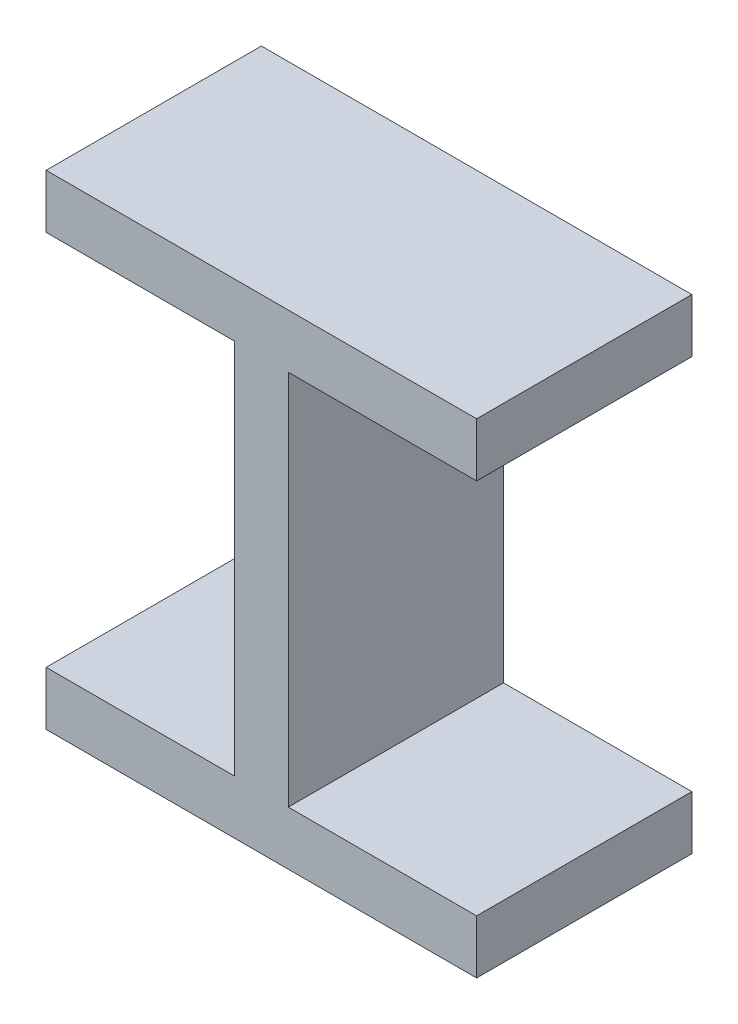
ISO-10303-21;
HEADER;
FILE_DESCRIPTION(('STEP AP214'),'2;1');
FILE_NAME('part.step','',(''),(''),'','','');
FILE_SCHEMA(('AUTOMOTIVE_DESIGN { 1 0 10303 214 1 1 1 1 }'));
ENDSEC;
DATA;
#1=APPLICATION_CONTEXT('core data for automotive mechanical design processes');
#2=APPLICATION_PROTOCOL_DEFINITION('international standard','automotive_design',2000,#1);
#3=PRODUCT_CONTEXT('',#1,'mechanical');
#4=PRODUCT('Part','Part','',(#3));
#5=PRODUCT_RELATED_PRODUCT_CATEGORY('part','',(#4));
#6=PRODUCT_DEFINITION_FORMATION('','',#4);
#7=PRODUCT_DEFINITION_CONTEXT('part definition',#1,'design');
#8=PRODUCT_DEFINITION('design','',#6,#7);
#9=PRODUCT_DEFINITION_SHAPE('','',#8);
#10=(LENGTH_UNIT() NAMED_UNIT(*) SI_UNIT(.MILLI.,.METRE.));
#11=(NAMED_UNIT(*) PLANE_ANGLE_UNIT() SI_UNIT($,.RADIAN.));
#12=(NAMED_UNIT(*) SI_UNIT($,.STERADIAN.) SOLID_ANGLE_UNIT());
#13=UNCERTAINTY_MEASURE_WITH_UNIT(LENGTH_MEASURE(1.E-05),#10,'distance_accuracy_value','');
#14=(GEOMETRIC_REPRESENTATION_CONTEXT(3) GLOBAL_UNCERTAINTY_ASSIGNED_CONTEXT((#13)) GLOBAL_UNIT_ASSIGNED_CONTEXT((#10,
#11,#12)) REPRESENTATION_CONTEXT('',''));
#15=CARTESIAN_POINT('',(0.,0.,0.));
#16=DIRECTION('',(0.,0.,1.));
#17=DIRECTION('',(1.,0.,0.));
#18=AXIS2_PLACEMENT_3D('',#15,#16,#17);
#19=CARTESIAN_POINT('',(0.,90.,80.));
#20=DIRECTION('',(0.,-1.,0.));
#21=DIRECTION('',(1.,0.,0.));
#22=AXIS2_PLACEMENT_3D('',#19,#20,#21);
#23=PLANE('',#22);
#24=DIRECTION('',(-1.,0.,0.));
#25=VECTOR('',#24,1.);
#26=CARTESIAN_POINT('',(0.,90.,0.));
#27=LINE('',#26,#25);
#28=CARTESIAN_POINT('',(80.,90.,0.));
#29=VERTEX_POINT('',#28);
#30=CARTESIAN_POINT('',(-80.,90.,0.));
#31=VERTEX_POINT('',#30);
#32=EDGE_CURVE('E159',#29,#31,#27,.T.);
#33=ORIENTED_EDGE('',*,*,#32,.T.);
#34=DIRECTION('',(0.,0.,-1.));
#35=VECTOR('',#34,1.);
#36=CARTESIAN_POINT('',(-80.,90.,80.));
#37=LINE('',#36,#35);
#38=CARTESIAN_POINT('',(-80.,90.,80.));
#39=VERTEX_POINT('',#38);
#40=EDGE_CURVE('E11',#39,#31,#37,.T.);
#41=ORIENTED_EDGE('',*,*,#40,.F.);
#42=DIRECTION('',(-1.,0.,0.));
#43=VECTOR('',#42,1.);
#44=CARTESIAN_POINT('',(0.,90.,80.));
#45=LINE('',#44,#43);
#46=CARTESIAN_POINT('',(80.,90.,80.));
#47=VERTEX_POINT('',#46);
#48=EDGE_CURVE('E187',#47,#39,#45,.T.);
#49=ORIENTED_EDGE('',*,*,#48,.F.);
#50=DIRECTION('',(0.,0.,-1.));
#51=VECTOR('',#50,1.);
#52=CARTESIAN_POINT('',(80.,90.,80.));
#53=LINE('',#52,#51);
#54=EDGE_CURVE('E54',#47,#29,#53,.T.);
#55=ORIENTED_EDGE('',*,*,#54,.T.);
#56=EDGE_LOOP('',(#33,#41,#49,#55));
#57=FACE_BOUND('',#56,.T.);
#58=ADVANCED_FACE('F38',(#57),#23,.F.);
#59=CARTESIAN_POINT('',(-80.,0.,80.));
#60=DIRECTION('',(1.,0.,0.));
#61=DIRECTION('',(0.,0.,-1.));
#62=AXIS2_PLACEMENT_3D('',#59,#60,#61);
#63=PLANE('',#62);
#64=DIRECTION('',(0.,-1.,0.));
#65=VECTOR('',#64,1.);
#66=CARTESIAN_POINT('',(-80.,0.,0.));
#67=LINE('',#66,#65);
#68=CARTESIAN_POINT('',(-80.,70.,0.));
#69=VERTEX_POINT('',#68);
#70=EDGE_CURVE('E161',#31,#69,#67,.T.);
#71=ORIENTED_EDGE('',*,*,#70,.T.);
#72=DIRECTION('',(0.,0.,-1.));
#73=VECTOR('',#72,1.);
#74=CARTESIAN_POINT('',(-80.,70.,80.));
#75=LINE('',#74,#73);
#76=CARTESIAN_POINT('',(-80.,70.,80.));
#77=VERTEX_POINT('',#76);
#78=EDGE_CURVE('E46',#77,#69,#75,.T.);
#79=ORIENTED_EDGE('',*,*,#78,.F.);
#80=DIRECTION('',(0.,-1.,0.));
#81=VECTOR('',#80,1.);
#82=CARTESIAN_POINT('',(-80.,0.,80.));
#83=LINE('',#82,#81);
#84=EDGE_CURVE('E104',#39,#77,#83,.T.);
#85=ORIENTED_EDGE('',*,*,#84,.F.);
#86=ORIENTED_EDGE('',*,*,#40,.T.);
#87=EDGE_LOOP('',(#71,#79,#85,#86));
#88=FACE_BOUND('',#87,.T.);
#89=ADVANCED_FACE('F256',(#88),#63,.F.);
#90=CARTESIAN_POINT('',(0.,70.,80.));
#91=DIRECTION('',(0.,1.,0.));
#92=DIRECTION('',(-1.,0.,0.));
#93=AXIS2_PLACEMENT_3D('',#90,#91,#92);
#94=PLANE('',#93);
#95=DIRECTION('',(1.,0.,0.));
#96=VECTOR('',#95,1.);
#97=CARTESIAN_POINT('',(0.,70.,0.));
#98=LINE('',#97,#96);
#99=CARTESIAN_POINT('',(-10.,70.,0.));
#100=VERTEX_POINT('',#99);
#101=EDGE_CURVE('E163',#69,#100,#98,.T.);
#102=ORIENTED_EDGE('',*,*,#101,.T.);
#103=DIRECTION('',(0.,0.,-1.));
#104=VECTOR('',#103,1.);
#105=CARTESIAN_POINT('',(-10.,70.,80.));
#106=LINE('',#105,#104);
#107=CARTESIAN_POINT('',(-10.,70.,80.));
#108=VERTEX_POINT('',#107);
#109=EDGE_CURVE('E202',#108,#100,#106,.T.);
#110=ORIENTED_EDGE('',*,*,#109,.F.);
#111=DIRECTION('',(1.,0.,0.));
#112=VECTOR('',#111,1.);
#113=CARTESIAN_POINT('',(0.,70.,80.));
#114=LINE('',#113,#112);
#115=EDGE_CURVE('E210',#77,#108,#114,.T.);
#116=ORIENTED_EDGE('',*,*,#115,.F.);
#117=ORIENTED_EDGE('',*,*,#78,.T.);
#118=EDGE_LOOP('',(#102,#110,#116,#117));
#119=FACE_BOUND('',#118,.T.);
#120=ADVANCED_FACE('F208',(#119),#94,.F.);
#121=CARTESIAN_POINT('',(-9.99999999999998,0.,80.));
#122=DIRECTION('',(1.,0.,0.));
#123=DIRECTION('',(0.,1.,0.));
#124=AXIS2_PLACEMENT_3D('',#121,#122,#123);
#125=PLANE('',#124);
#126=DIRECTION('',(0.,-1.,0.));
#127=VECTOR('',#126,1.);
#128=CARTESIAN_POINT('',(-9.99999999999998,0.,0.));
#129=LINE('',#128,#127);
#130=CARTESIAN_POINT('',(-9.99999999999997,-70.,0.));
#131=VERTEX_POINT('',#130);
#132=EDGE_CURVE('E165',#100,#131,#129,.T.);
#133=ORIENTED_EDGE('',*,*,#132,.T.);
#134=DIRECTION('',(0.,0.,-1.));
#135=VECTOR('',#134,1.);
#136=CARTESIAN_POINT('',(-9.99999999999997,-70.,80.));
#137=LINE('',#136,#135);
#138=CARTESIAN_POINT('',(-9.99999999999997,-70.,80.));
#139=VERTEX_POINT('',#138);
#140=EDGE_CURVE('E200',#139,#131,#137,.T.);
#141=ORIENTED_EDGE('',*,*,#140,.F.);
#142=DIRECTION('',(0.,-1.,0.));
#143=VECTOR('',#142,1.);
#144=CARTESIAN_POINT('',(-9.99999999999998,0.,80.));
#145=LINE('',#144,#143);
#146=EDGE_CURVE('E220',#108,#139,#145,.T.);
#147=ORIENTED_EDGE('',*,*,#146,.F.);
#148=ORIENTED_EDGE('',*,*,#109,.T.);
#149=EDGE_LOOP('',(#133,#141,#147,#148));
#150=FACE_BOUND('',#149,.T.);
#151=ADVANCED_FACE('F217',(#150),#125,.F.);
#152=CARTESIAN_POINT('',(0.,-70.,80.));
#153=DIRECTION('',(0.,1.,0.));
#154=DIRECTION('',(-1.,0.,0.));
#155=AXIS2_PLACEMENT_3D('',#152,#153,#154);
#156=PLANE('',#155);
#157=DIRECTION('',(1.,0.,0.));
#158=VECTOR('',#157,1.);
#159=CARTESIAN_POINT('',(0.,-70.,0.));
#160=LINE('',#159,#158);
#161=CARTESIAN_POINT('',(-80.,-70.,0.));
#162=VERTEX_POINT('',#161);
#163=EDGE_CURVE('E168',#162,#131,#160,.T.);
#164=ORIENTED_EDGE('',*,*,#163,.F.);
#165=DIRECTION('',(0.,0.,-1.));
#166=VECTOR('',#165,1.);
#167=CARTESIAN_POINT('',(-80.,-70.,80.));
#168=LINE('',#167,#166);
#169=CARTESIAN_POINT('',(-80.,-70.,80.));
#170=VERTEX_POINT('',#169);
#171=EDGE_CURVE('E198',#170,#162,#168,.T.);
#172=ORIENTED_EDGE('',*,*,#171,.F.);
#173=DIRECTION('',(1.,0.,0.));
#174=VECTOR('',#173,1.);
#175=CARTESIAN_POINT('',(0.,-70.,80.));
#176=LINE('',#175,#174);
#177=EDGE_CURVE('E222',#170,#139,#176,.T.);
#178=ORIENTED_EDGE('',*,*,#177,.T.);
#179=ORIENTED_EDGE('',*,*,#140,.T.);
#180=EDGE_LOOP('',(#164,#172,#178,#179));
#181=FACE_BOUND('',#180,.T.);
#182=ADVANCED_FACE('F269',(#181),#156,.T.);
#183=CARTESIAN_POINT('',(-80.,0.,80.));
#184=DIRECTION('',(-1.,0.,0.));
#185=DIRECTION('',(0.,0.,1.));
#186=AXIS2_PLACEMENT_3D('',#183,#184,#185);
#187=PLANE('',#186);
#188=DIRECTION('',(0.,1.,0.));
#189=VECTOR('',#188,1.);
#190=CARTESIAN_POINT('',(-80.,0.,0.));
#191=LINE('',#190,#189);
#192=CARTESIAN_POINT('',(-80.,-90.,0.));
#193=VERTEX_POINT('',#192);
#194=EDGE_CURVE('E171',#193,#162,#191,.T.);
#195=ORIENTED_EDGE('',*,*,#194,.F.);
#196=DIRECTION('',(0.,0.,-1.));
#197=VECTOR('',#196,1.);
#198=CARTESIAN_POINT('',(-80.,-90.,80.));
#199=LINE('',#198,#197);
#200=CARTESIAN_POINT('',(-80.,-90.,80.));
#201=VERTEX_POINT('',#200);
#202=EDGE_CURVE('E196',#201,#193,#199,.T.);
#203=ORIENTED_EDGE('',*,*,#202,.F.);
#204=DIRECTION('',(0.,1.,0.));
#205=VECTOR('',#204,1.);
#206=CARTESIAN_POINT('',(-80.,0.,80.));
#207=LINE('',#206,#205);
#208=EDGE_CURVE('E224',#201,#170,#207,.T.);
#209=ORIENTED_EDGE('',*,*,#208,.T.);
#210=ORIENTED_EDGE('',*,*,#171,.T.);
#211=EDGE_LOOP('',(#195,#203,#209,#210));
#212=FACE_BOUND('',#211,.T.);
#213=ADVANCED_FACE('F272',(#212),#187,.T.);
#214=CARTESIAN_POINT('',(0.,-90.,80.));
#215=DIRECTION('',(0.,-1.,0.));
#216=DIRECTION('',(1.,0.,0.));
#217=AXIS2_PLACEMENT_3D('',#214,#215,#216);
#218=PLANE('',#217);
#219=DIRECTION('',(-1.,0.,0.));
#220=VECTOR('',#219,1.);
#221=CARTESIAN_POINT('',(0.,-90.,0.));
#222=LINE('',#221,#220);
#223=CARTESIAN_POINT('',(80.,-90.,0.));
#224=VERTEX_POINT('',#223);
#225=EDGE_CURVE('E174',#224,#193,#222,.T.);
#226=ORIENTED_EDGE('',*,*,#225,.F.);
#227=DIRECTION('',(0.,0.,-1.));
#228=VECTOR('',#227,1.);
#229=CARTESIAN_POINT('',(80.,-90.,80.));
#230=LINE('',#229,#228);
#231=CARTESIAN_POINT('',(80.,-90.,80.));
#232=VERTEX_POINT('',#231);
#233=EDGE_CURVE('E194',#232,#224,#230,.T.);
#234=ORIENTED_EDGE('',*,*,#233,.F.);
#235=DIRECTION('',(-1.,0.,0.));
#236=VECTOR('',#235,1.);
#237=CARTESIAN_POINT('',(0.,-90.,80.));
#238=LINE('',#237,#236);
#239=EDGE_CURVE('E231',#232,#201,#238,.T.);
#240=ORIENTED_EDGE('',*,*,#239,.T.);
#241=ORIENTED_EDGE('',*,*,#202,.T.);
#242=EDGE_LOOP('',(#226,#234,#240,#241));
#243=FACE_BOUND('',#242,.T.);
#244=ADVANCED_FACE('F276',(#243),#218,.T.);
#245=CARTESIAN_POINT('',(80.,0.,80.));
#246=DIRECTION('',(-1.,0.,0.));
#247=DIRECTION('',(0.,0.,1.));
#248=AXIS2_PLACEMENT_3D('',#245,#246,#247);
#249=PLANE('',#248);
#250=DIRECTION('',(0.,1.,0.));
#251=VECTOR('',#250,1.);
#252=CARTESIAN_POINT('',(80.,0.,0.));
#253=LINE('',#252,#251);
#254=CARTESIAN_POINT('',(80.,-70.,0.));
#255=VERTEX_POINT('',#254);
#256=EDGE_CURVE('E177',#224,#255,#253,.T.);
#257=ORIENTED_EDGE('',*,*,#256,.T.);
#258=DIRECTION('',(0.,0.,-1.));
#259=VECTOR('',#258,1.);
#260=CARTESIAN_POINT('',(80.,-70.,80.));
#261=LINE('',#260,#259);
#262=CARTESIAN_POINT('',(80.,-70.,80.));
#263=VERTEX_POINT('',#262);
#264=EDGE_CURVE('E191',#263,#255,#261,.T.);
#265=ORIENTED_EDGE('',*,*,#264,.F.);
#266=DIRECTION('',(0.,1.,0.));
#267=VECTOR('',#266,1.);
#268=CARTESIAN_POINT('',(80.,0.,80.));
#269=LINE('',#268,#267);
#270=EDGE_CURVE('E234',#232,#263,#269,.T.);
#271=ORIENTED_EDGE('',*,*,#270,.F.);
#272=ORIENTED_EDGE('',*,*,#233,.T.);
#273=EDGE_LOOP('',(#257,#265,#271,#272));
#274=FACE_BOUND('',#273,.T.);
#275=ADVANCED_FACE('F240',(#274),#249,.F.);
#276=CARTESIAN_POINT('',(0.,-70.,80.));
#277=DIRECTION('',(0.,-1.,0.));
#278=DIRECTION('',(1.,0.,0.));
#279=AXIS2_PLACEMENT_3D('',#276,#277,#278);
#280=PLANE('',#279);
#281=DIRECTION('',(-1.,0.,0.));
#282=VECTOR('',#281,1.);
#283=CARTESIAN_POINT('',(0.,-70.,0.));
#284=LINE('',#283,#282);
#285=CARTESIAN_POINT('',(10.,-70.,0.));
#286=VERTEX_POINT('',#285);
#287=EDGE_CURVE('E179',#255,#286,#284,.T.);
#288=ORIENTED_EDGE('',*,*,#287,.T.);
#289=DIRECTION('',(0.,0.,-1.));
#290=VECTOR('',#289,1.);
#291=CARTESIAN_POINT('',(10.,-70.,80.));
#292=LINE('',#291,#290);
#293=CARTESIAN_POINT('',(10.,-70.,80.));
#294=VERTEX_POINT('',#293);
#295=EDGE_CURVE('E151',#294,#286,#292,.T.);
#296=ORIENTED_EDGE('',*,*,#295,.F.);
#297=DIRECTION('',(-1.,0.,0.));
#298=VECTOR('',#297,1.);
#299=CARTESIAN_POINT('',(0.,-70.,80.));
#300=LINE('',#299,#298);
#301=EDGE_CURVE('E139',#263,#294,#300,.T.);
#302=ORIENTED_EDGE('',*,*,#301,.F.);
#303=ORIENTED_EDGE('',*,*,#264,.T.);
#304=EDGE_LOOP('',(#288,#296,#302,#303));
#305=FACE_BOUND('',#304,.T.);
#306=ADVANCED_FACE('F244',(#305),#280,.F.);
#307=CARTESIAN_POINT('',(10.,0.,80.));
#308=DIRECTION('',(-1.,0.,0.));
#309=DIRECTION('',(0.,-1.,0.));
#310=AXIS2_PLACEMENT_3D('',#307,#308,#309);
#311=PLANE('',#310);
#312=DIRECTION('',(0.,1.,0.));
#313=VECTOR('',#312,1.);
#314=CARTESIAN_POINT('',(10.,0.,0.));
#315=LINE('',#314,#313);
#316=CARTESIAN_POINT('',(10.,70.,0.));
#317=VERTEX_POINT('',#316);
#318=EDGE_CURVE('E148',#286,#317,#315,.T.);
#319=ORIENTED_EDGE('',*,*,#318,.T.);
#320=DIRECTION('',(0.,0.,-1.));
#321=VECTOR('',#320,1.);
#322=CARTESIAN_POINT('',(10.,70.,80.));
#323=LINE('',#322,#321);
#324=CARTESIAN_POINT('',(10.,70.,80.));
#325=VERTEX_POINT('',#324);
#326=EDGE_CURVE('E145',#325,#317,#323,.T.);
#327=ORIENTED_EDGE('',*,*,#326,.F.);
#328=DIRECTION('',(0.,1.,0.));
#329=VECTOR('',#328,1.);
#330=CARTESIAN_POINT('',(10.,0.,80.));
#331=LINE('',#330,#329);
#332=EDGE_CURVE('E132',#294,#325,#331,.T.);
#333=ORIENTED_EDGE('',*,*,#332,.F.);
#334=ORIENTED_EDGE('',*,*,#295,.T.);
#335=EDGE_LOOP('',(#319,#327,#333,#334));
#336=FACE_BOUND('',#335,.T.);
#337=ADVANCED_FACE('F146',(#336),#311,.F.);
#338=CARTESIAN_POINT('',(0.,70.,80.));
#339=DIRECTION('',(0.,-1.,0.));
#340=DIRECTION('',(0.,0.,-1.));
#341=AXIS2_PLACEMENT_3D('',#338,#339,#340);
#342=PLANE('',#341);
#343=DIRECTION('',(-1.,0.,0.));
#344=VECTOR('',#343,1.);
#345=CARTESIAN_POINT('',(0.,70.,0.));
#346=LINE('',#345,#344);
#347=CARTESIAN_POINT('',(80.,70.,0.));
#348=VERTEX_POINT('',#347);
#349=EDGE_CURVE('E182',#348,#317,#346,.T.);
#350=ORIENTED_EDGE('',*,*,#349,.F.);
#351=DIRECTION('',(0.,0.,-1.));
#352=VECTOR('',#351,1.);
#353=CARTESIAN_POINT('',(80.,70.,80.));
#354=LINE('',#353,#352);
#355=CARTESIAN_POINT('',(80.,70.,80.));
#356=VERTEX_POINT('',#355);
#357=EDGE_CURVE('E92',#356,#348,#354,.T.);
#358=ORIENTED_EDGE('',*,*,#357,.F.);
#359=DIRECTION('',(-1.,0.,0.));
#360=VECTOR('',#359,1.);
#361=CARTESIAN_POINT('',(0.,70.,80.));
#362=LINE('',#361,#360);
#363=EDGE_CURVE('E137',#356,#325,#362,.T.);
#364=ORIENTED_EDGE('',*,*,#363,.T.);
#365=ORIENTED_EDGE('',*,*,#326,.T.);
#366=EDGE_LOOP('',(#350,#358,#364,#365));
#367=FACE_BOUND('',#366,.T.);
#368=ADVANCED_FACE('F153',(#367),#342,.T.);
#369=CARTESIAN_POINT('',(80.,0.,80.));
#370=DIRECTION('',(1.,0.,0.));
#371=DIRECTION('',(0.,0.,-1.));
#372=AXIS2_PLACEMENT_3D('',#369,#370,#371);
#373=PLANE('',#372);
#374=DIRECTION('',(0.,-1.,0.));
#375=VECTOR('',#374,1.);
#376=CARTESIAN_POINT('',(80.,0.,0.));
#377=LINE('',#376,#375);
#378=EDGE_CURVE('E184',#29,#348,#377,.T.);
#379=ORIENTED_EDGE('',*,*,#378,.F.);
#380=ORIENTED_EDGE('',*,*,#54,.F.);
#381=DIRECTION('',(0.,-1.,0.));
#382=VECTOR('',#381,1.);
#383=CARTESIAN_POINT('',(80.,0.,80.));
#384=LINE('',#383,#382);
#385=EDGE_CURVE('E154',#47,#356,#384,.T.);
#386=ORIENTED_EDGE('',*,*,#385,.T.);
#387=ORIENTED_EDGE('',*,*,#357,.T.);
#388=EDGE_LOOP('',(#379,#380,#386,#387));
#389=FACE_BOUND('',#388,.T.);
#390=ADVANCED_FACE('F245',(#389),#373,.T.);
#391=CARTESIAN_POINT('',(0.,0.,80.));
#392=DIRECTION('',(0.,0.,1.));
#393=DIRECTION('',(1.,0.,0.));
#394=AXIS2_PLACEMENT_3D('',#391,#392,#393);
#395=PLANE('',#394);
#396=ORIENTED_EDGE('',*,*,#48,.T.);
#397=ORIENTED_EDGE('',*,*,#84,.T.);
#398=ORIENTED_EDGE('',*,*,#115,.T.);
#399=ORIENTED_EDGE('',*,*,#146,.T.);
#400=ORIENTED_EDGE('',*,*,#177,.F.);
#401=ORIENTED_EDGE('',*,*,#208,.F.);
#402=ORIENTED_EDGE('',*,*,#239,.F.);
#403=ORIENTED_EDGE('',*,*,#270,.T.);
#404=ORIENTED_EDGE('',*,*,#301,.T.);
#405=ORIENTED_EDGE('',*,*,#332,.T.);
#406=ORIENTED_EDGE('',*,*,#363,.F.);
#407=ORIENTED_EDGE('',*,*,#385,.F.);
#408=EDGE_LOOP('',(#396,#397,#398,#399,#400,#401,#402,#403,#404,#405,#406,#407));
#409=FACE_BOUND('',#408,.T.);
#410=ADVANCED_FACE('F134',(#409),#395,.T.);
#411=CARTESIAN_POINT('',(0.,0.,0.));
#412=DIRECTION('',(0.,0.,1.));
#413=DIRECTION('',(1.,0.,0.));
#414=AXIS2_PLACEMENT_3D('',#411,#412,#413);
#415=PLANE('',#414);
#416=ORIENTED_EDGE('',*,*,#32,.F.);
#417=ORIENTED_EDGE('',*,*,#378,.T.);
#418=ORIENTED_EDGE('',*,*,#349,.T.);
#419=ORIENTED_EDGE('',*,*,#318,.F.);
#420=ORIENTED_EDGE('',*,*,#287,.F.);
#421=ORIENTED_EDGE('',*,*,#256,.F.);
#422=ORIENTED_EDGE('',*,*,#225,.T.);
#423=ORIENTED_EDGE('',*,*,#194,.T.);
#424=ORIENTED_EDGE('',*,*,#163,.T.);
#425=ORIENTED_EDGE('',*,*,#132,.F.);
#426=ORIENTED_EDGE('',*,*,#101,.F.);
#427=ORIENTED_EDGE('',*,*,#70,.F.);
#428=EDGE_LOOP('',(#416,#417,#418,#419,#420,#421,#422,#423,#424,#425,#426,#427));
#429=FACE_BOUND('',#428,.T.);
#430=ADVANCED_FACE('F213',(#429),#415,.F.);
#431=CLOSED_SHELL('',(#58,#89,#120,#151,#182,#213,#244,#275,#306,#337,#368,#390,#410,#430));
#432=MANIFOLD_SOLID_BREP('B2',#431);
#433=ADVANCED_BREP_SHAPE_REPRESENTATION('',(#18,#432),#14);
#434=SHAPE_DEFINITION_REPRESENTATION(#9,#433);
ENDSEC;
END-ISO-10303-21;
